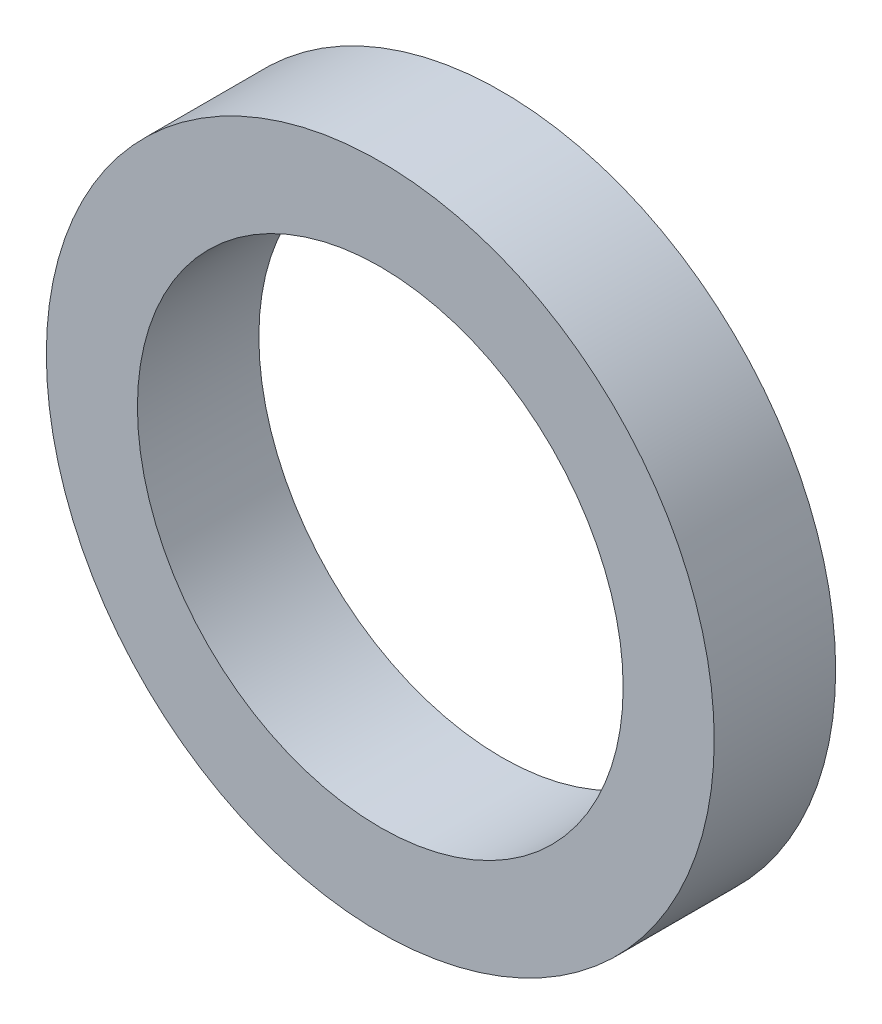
ISO-10303-21;
HEADER;
FILE_DESCRIPTION(('STEP AP214'),'2;1');
FILE_NAME('part.step','',(''),(''),'','','');
FILE_SCHEMA(('AUTOMOTIVE_DESIGN { 1 0 10303 214 1 1 1 1 }'));
ENDSEC;
DATA;
#1=APPLICATION_CONTEXT('core data for automotive mechanical design processes');
#2=APPLICATION_PROTOCOL_DEFINITION('international standard','automotive_design',2000,#1);
#3=PRODUCT_CONTEXT('',#1,'mechanical');
#4=PRODUCT('Part','Part','',(#3));
#5=PRODUCT_RELATED_PRODUCT_CATEGORY('part','',(#4));
#6=PRODUCT_DEFINITION_FORMATION('','',#4);
#7=PRODUCT_DEFINITION_CONTEXT('part definition',#1,'design');
#8=PRODUCT_DEFINITION('design','',#6,#7);
#9=PRODUCT_DEFINITION_SHAPE('','',#8);
#10=(LENGTH_UNIT() NAMED_UNIT(*) SI_UNIT(.MILLI.,.METRE.));
#11=(NAMED_UNIT(*) PLANE_ANGLE_UNIT() SI_UNIT($,.RADIAN.));
#12=(NAMED_UNIT(*) SI_UNIT($,.STERADIAN.) SOLID_ANGLE_UNIT());
#13=UNCERTAINTY_MEASURE_WITH_UNIT(LENGTH_MEASURE(1.E-05),#10,'distance_accuracy_value','');
#14=(GEOMETRIC_REPRESENTATION_CONTEXT(3) GLOBAL_UNCERTAINTY_ASSIGNED_CONTEXT((#13)) GLOBAL_UNIT_ASSIGNED_CONTEXT((#10,
#11,#12)) REPRESENTATION_CONTEXT('',''));
#15=CARTESIAN_POINT('',(0.,0.,0.));
#16=DIRECTION('',(0.,0.,1.));
#17=DIRECTION('',(1.,0.,0.));
#18=AXIS2_PLACEMENT_3D('',#15,#16,#17);
#19=CARTESIAN_POINT('',(0.,0.,2.));
#20=DIRECTION('',(0.,0.,-1.));
#21=DIRECTION('',(0.,1.,0.));
#22=AXIS2_PLACEMENT_3D('',#19,#20,#21);
#23=CYLINDRICAL_SURFACE('',#22,4.);
#24=CARTESIAN_POINT('',(0.,0.,2.));
#25=DIRECTION('',(0.,0.,-1.));
#26=DIRECTION('',(1.,0.,0.));
#27=AXIS2_PLACEMENT_3D('',#24,#25,#26);
#28=CIRCLE('',#27,4.);
#29=CARTESIAN_POINT('',(4.,0.,2.));
#30=VERTEX_POINT('',#29);
#31=EDGE_CURVE('E8',#30,#30,#28,.T.);
#32=ORIENTED_EDGE('',*,*,#31,.F.);
#33=EDGE_LOOP('',(#32));
#34=FACE_BOUND('',#33,.T.);
#35=CARTESIAN_POINT('',(0.,0.,0.));
#36=DIRECTION('',(0.,0.,-1.));
#37=DIRECTION('',(1.,0.,0.));
#38=AXIS2_PLACEMENT_3D('',#35,#36,#37);
#39=CIRCLE('',#38,4.);
#40=CARTESIAN_POINT('',(4.,0.,0.));
#41=VERTEX_POINT('',#40);
#42=EDGE_CURVE('E23',#41,#41,#39,.T.);
#43=ORIENTED_EDGE('',*,*,#42,.T.);
#44=EDGE_LOOP('',(#43));
#45=FACE_BOUND('',#44,.T.);
#46=ADVANCED_FACE('F12',(#34,#45),#23,.F.);
#47=CARTESIAN_POINT('',(0.,0.,2.));
#48=DIRECTION('',(0.,0.,-1.));
#49=DIRECTION('',(0.,1.,0.));
#50=AXIS2_PLACEMENT_3D('',#47,#48,#49);
#51=CYLINDRICAL_SURFACE('',#50,5.5);
#52=CARTESIAN_POINT('',(0.,0.,2.));
#53=DIRECTION('',(0.,0.,-1.));
#54=DIRECTION('',(1.,0.,0.));
#55=AXIS2_PLACEMENT_3D('',#52,#53,#54);
#56=CIRCLE('',#55,5.5);
#57=CARTESIAN_POINT('',(5.5,0.,2.));
#58=VERTEX_POINT('',#57);
#59=EDGE_CURVE('E19',#58,#58,#56,.T.);
#60=ORIENTED_EDGE('',*,*,#59,.T.);
#61=EDGE_LOOP('',(#60));
#62=FACE_BOUND('',#61,.T.);
#63=CARTESIAN_POINT('',(0.,0.,0.));
#64=DIRECTION('',(0.,0.,-1.));
#65=DIRECTION('',(1.,0.,0.));
#66=AXIS2_PLACEMENT_3D('',#63,#64,#65);
#67=CIRCLE('',#66,5.5);
#68=CARTESIAN_POINT('',(5.5,0.,0.));
#69=VERTEX_POINT('',#68);
#70=EDGE_CURVE('E28',#69,#69,#67,.T.);
#71=ORIENTED_EDGE('',*,*,#70,.F.);
#72=EDGE_LOOP('',(#71));
#73=FACE_BOUND('',#72,.T.);
#74=ADVANCED_FACE('F14',(#62,#73),#51,.T.);
#75=CARTESIAN_POINT('',(0.,0.,2.));
#76=DIRECTION('',(0.,0.,-1.));
#77=DIRECTION('',(0.,1.,0.));
#78=AXIS2_PLACEMENT_3D('',#75,#76,#77);
#79=PLANE('',#78);
#80=ORIENTED_EDGE('',*,*,#31,.T.);
#81=EDGE_LOOP('',(#80));
#82=FACE_BOUND('',#81,.T.);
#83=ORIENTED_EDGE('',*,*,#59,.F.);
#84=EDGE_LOOP('',(#83));
#85=FACE_BOUND('',#84,.T.);
#86=ADVANCED_FACE('F40',(#82,#85),#79,.F.);
#87=CARTESIAN_POINT('',(0.,0.,0.));
#88=DIRECTION('',(0.,0.,-1.));
#89=DIRECTION('',(0.,1.,0.));
#90=AXIS2_PLACEMENT_3D('',#87,#88,#89);
#91=PLANE('',#90);
#92=ORIENTED_EDGE('',*,*,#42,.F.);
#93=EDGE_LOOP('',(#92));
#94=FACE_BOUND('',#93,.T.);
#95=ORIENTED_EDGE('',*,*,#70,.T.);
#96=EDGE_LOOP('',(#95));
#97=FACE_BOUND('',#96,.T.);
#98=ADVANCED_FACE('F37',(#94,#97),#91,.T.);
#99=CLOSED_SHELL('',(#46,#74,#86,#98));
#100=MANIFOLD_SOLID_BREP('B1',#99);
#101=ADVANCED_BREP_SHAPE_REPRESENTATION('',(#18,#100),#14);
#102=SHAPE_DEFINITION_REPRESENTATION(#9,#101);
ENDSEC;
END-ISO-10303-21;
